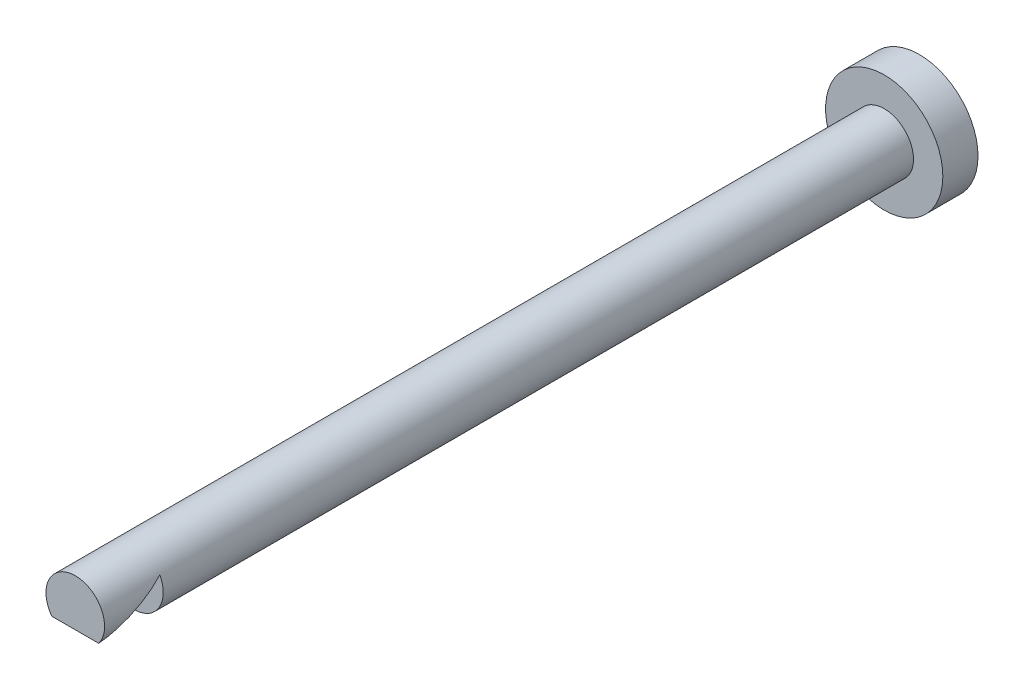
from build123d import *

# Parameters (mm, degrees)
ESQUISSE1_R           = 5
EXTRUSION1_DEPTH      = 3
ESQUISSE2_R           = 2.5
EXTRUSION2_DEPTH      = 69
EXTRUSION3_DEPTH      = 73.465509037
EXTRUSION3_DEPTH_BACK = 73.465509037


with BuildPart() as part:
    # Esquisse1 → Extrusion1 (new body)
    with BuildSketch(Plane.XY):
        Circle(ESQUISSE1_R)
    extrude(amount=EXTRUSION1_DEPTH)

    # Esquisse2 → Extrusion2 (add)
    with BuildSketch(Plane.XY.offset(3)):
        Circle(ESQUISSE2_R)
    extrude(amount=EXTRUSION2_DEPTH)

    # Esquisse3D2 → Extrusion3 (cut, two sides: drawn at the far end of the back side and taken through both)
    with BuildSketch(Plane(origin=(0, -1.5, 72), x_dir=(0, 0.4704498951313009, -0.882426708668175), z_dir=(-1, 0, 0)).offset(-EXTRUSION3_DEPTH_BACK)):
        Polygon((0, 0), (5.666192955, 0), (3.941683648, 3.234676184), (-0.470449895, 0.882426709), align=None)
    extrude(amount=EXTRUSION3_DEPTH + EXTRUSION3_DEPTH_BACK, mode=Mode.SUBTRACT)


solid = part.part
